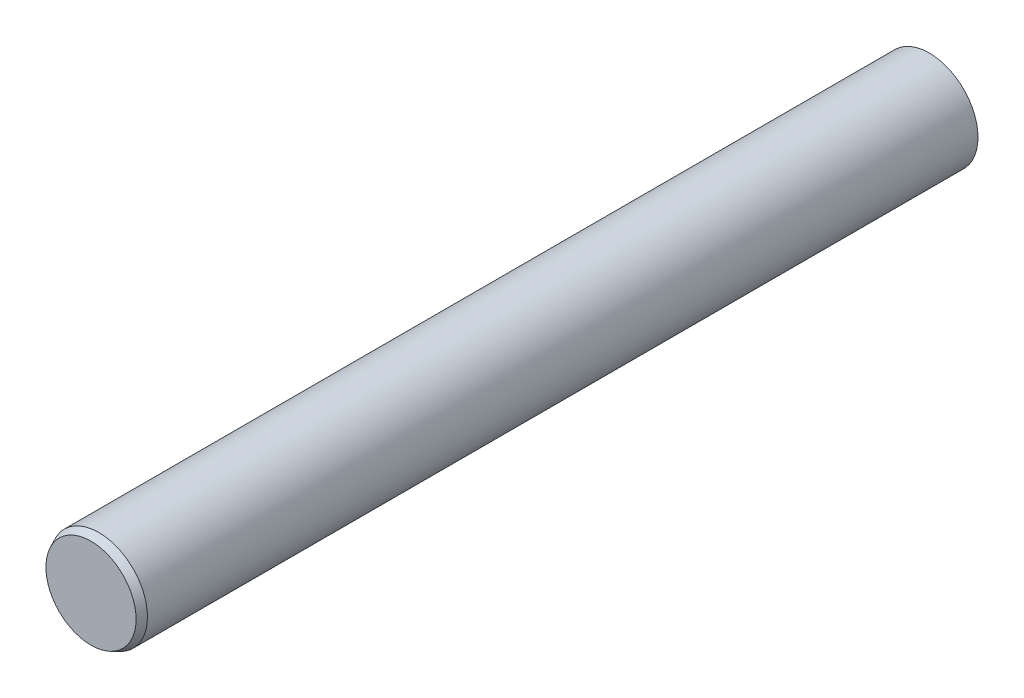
from build123d import *
from OCP.BRepFilletAPI import BRepFilletAPI_MakeChamfer

# Parameters (mm, degrees)
SKETCH1_R           = 2.3876
BOSS_EXTRUDE1_DEPTH = 20.6375
CHAMFER1_SIZE       = 0.381
CHAMFER1_SIZE2      = 0.177663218


with BuildPart() as part:
    # Sketch1 → Boss-Extrude1 (new, symmetric)
    with BuildSketch(Plane.XY):
        Circle(SKETCH1_R)
    extrude(amount=BOSS_EXTRUDE1_DEPTH, both=True)

    # Chamfer1: one chamfer whose edges measure the first distance from different faces: ONE call of the kernel's chamfer builder (chamfer() names one face for all edges)
    chamfer1_edges_1 = [part.edges().sort_by_distance(p)[0] for p in [
        (-2.3876, 0, -20.6375),
    ]]
    chamfer1_side_1 = [part.faces().sort_by_distance(p)[0] for p in [
        (0, 0, -20.6375),
    ]]
    chamfer1_edges_2 = [part.edges().sort_by_distance(p)[0] for p in [
        (-2.3876, 0, 20.6375),
    ]]
    chamfer1_side_2 = [part.faces().sort_by_distance(p)[0] for p in [
        (-2.3876, 0, 0),
    ]]
    chamfer1 = BRepFilletAPI_MakeChamfer(part.part.solid().wrapped)
    for e in chamfer1_edges_1:
        chamfer1.Add(CHAMFER1_SIZE, CHAMFER1_SIZE2, e.wrapped, chamfer1_side_1[0].wrapped)  # the first distance lies on this face
    for e in chamfer1_edges_2:
        chamfer1.Add(CHAMFER1_SIZE, CHAMFER1_SIZE2, e.wrapped, chamfer1_side_2[0].wrapped)  # the first distance lies on this face
    add(Compound.cast(chamfer1.Shape()), mode=Mode.REPLACE)


solid = part.part
